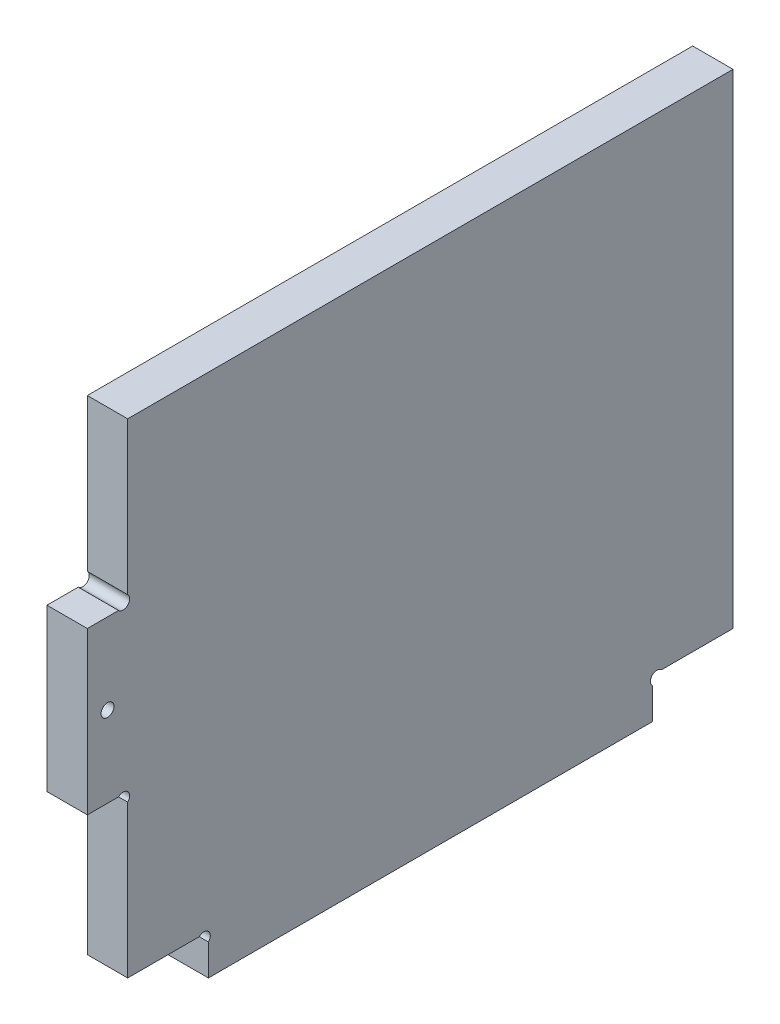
from build123d import *

# Parameters (mm, degrees)
ESQUISSE1_R      = 1.6
EXTRUSION1_DEPTH = 10


with BuildPart() as part:
    # Esquisse1 → Extrusion1 (new body)
    with BuildSketch(Plane(origin=(0, 0, 0), x_dir=(0, 0, -1), z_dir=(1, 0, 0))):
        with BuildLine():
            Line((140, 7.7372583), (140, 0))
            Line((140, 0), (30, 0))
            Line((30, 0), (30, 7.7372583))
            ThreePointArc((30, 7.7372583), (30, 10), (27.7372583, 10))
            Line((27.7372583, 10), (10, 10))
            Line((10, 10), (10, 47.7372583))
            ThreePointArc((10, 47.7372583), (10, 50), (7.7372583, 50))
            Line((7.7372583, 50), (0, 50))
            Line((0, 50), (0, 90))
            Line((0, 90), (7.7372583, 90))
            ThreePointArc((7.7372583, 90), (10, 90), (10, 92.2627417))
            Line((10, 92.2627417), (10, 130))
            Line((10, 130), (160, 130))
            Line((160, 130), (160, 10))
            Line((160, 10), (142.2627417, 10))
            ThreePointArc((142.2627417, 10), (140, 10), (140, 7.7372583))
        make_face()
        with Locations((5, 70)):
            Circle(ESQUISSE1_R, mode=Mode.SUBTRACT)
    extrude(amount=EXTRUSION1_DEPTH)


solid = part.part
